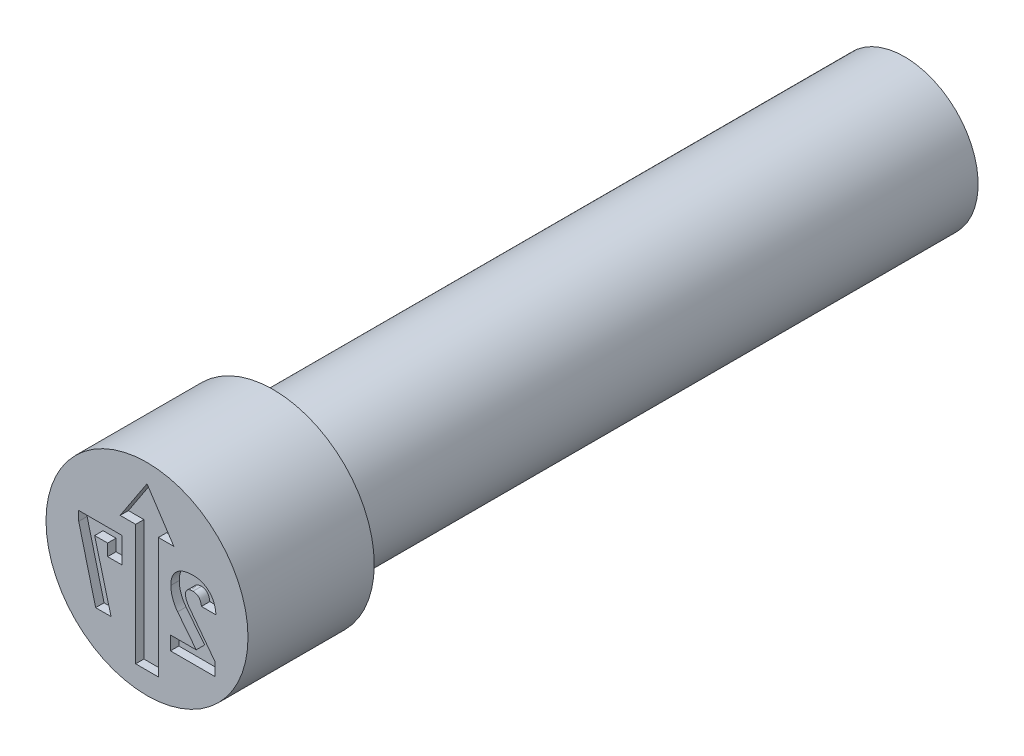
ISO-10303-21;
HEADER;
FILE_DESCRIPTION(('STEP AP214'),'2;1');
FILE_NAME('part.step','',(''),(''),'','','');
FILE_SCHEMA(('AUTOMOTIVE_DESIGN { 1 0 10303 214 1 1 1 1 }'));
ENDSEC;
DATA;
#1=APPLICATION_CONTEXT('core data for automotive mechanical design processes');
#2=APPLICATION_PROTOCOL_DEFINITION('international standard','automotive_design',2000,#1);
#3=PRODUCT_CONTEXT('',#1,'mechanical');
#4=PRODUCT('Part','Part','',(#3));
#5=PRODUCT_RELATED_PRODUCT_CATEGORY('part','',(#4));
#6=PRODUCT_DEFINITION_FORMATION('','',#4);
#7=PRODUCT_DEFINITION_CONTEXT('part definition',#1,'design');
#8=PRODUCT_DEFINITION('design','',#6,#7);
#9=PRODUCT_DEFINITION_SHAPE('','',#8);
#10=(LENGTH_UNIT() NAMED_UNIT(*) SI_UNIT(.MILLI.,.METRE.));
#11=(NAMED_UNIT(*) PLANE_ANGLE_UNIT() SI_UNIT($,.RADIAN.));
#12=(NAMED_UNIT(*) SI_UNIT($,.STERADIAN.) SOLID_ANGLE_UNIT());
#13=UNCERTAINTY_MEASURE_WITH_UNIT(LENGTH_MEASURE(1.E-05),#10,'distance_accuracy_value','');
#14=(GEOMETRIC_REPRESENTATION_CONTEXT(3) GLOBAL_UNCERTAINTY_ASSIGNED_CONTEXT((#13)) GLOBAL_UNIT_ASSIGNED_CONTEXT((#10,
#11,#12)) REPRESENTATION_CONTEXT('',''));
#15=CARTESIAN_POINT('',(0.,0.,0.));
#16=DIRECTION('',(0.,0.,1.));
#17=DIRECTION('',(1.,0.,0.));
#18=AXIS2_PLACEMENT_3D('',#15,#16,#17);
#19=CARTESIAN_POINT('',(-0.27,-1.88,-3.34769690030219));
#20=DIRECTION('',(-1.,0.,0.));
#21=DIRECTION('',(0.,0.,1.));
#22=AXIS2_PLACEMENT_3D('',#19,#20,#21);
#23=PLANE('',#22);
#24=DIRECTION('',(0.,-1.,0.));
#25=VECTOR('',#24,1.);
#26=CARTESIAN_POINT('',(-0.27,0.990629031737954,-0.19671914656));
#27=LINE('',#26,#25);
#28=CARTESIAN_POINT('',(-0.27,0.990629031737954,-0.19671914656));
#29=VERTEX_POINT('',#28);
#30=CARTESIAN_POINT('',(-0.27,-1.88,-0.19671914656));
#31=VERTEX_POINT('',#30);
#32=EDGE_CURVE('E439',#29,#31,#27,.T.);
#33=ORIENTED_EDGE('',*,*,#32,.F.);
#34=DIRECTION('',(0.,0.,1.));
#35=VECTOR('',#34,1.);
#36=CARTESIAN_POINT('',(-0.27,0.990629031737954,-0.21335957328));
#37=LINE('',#36,#35);
#38=CARTESIAN_POINT('',(-0.27,0.990629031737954,0.));
#39=VERTEX_POINT('',#38);
#40=EDGE_CURVE('E425',#39,#29,#37,.F.);
#41=ORIENTED_EDGE('',*,*,#40,.F.);
#42=DIRECTION('',(0.,1.,0.));
#43=VECTOR('',#42,1.);
#44=CARTESIAN_POINT('',(-0.27,0.,0.));
#45=LINE('',#44,#43);
#46=CARTESIAN_POINT('',(-0.27,-1.88,0.));
#47=VERTEX_POINT('',#46);
#48=EDGE_CURVE('E468',#47,#39,#45,.T.);
#49=ORIENTED_EDGE('',*,*,#48,.F.);
#50=DIRECTION('',(0.,0.,-1.));
#51=VECTOR('',#50,1.);
#52=CARTESIAN_POINT('',(-0.27,-1.88,-3.34769690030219));
#53=LINE('',#52,#51);
#54=EDGE_CURVE('E470',#47,#31,#53,.T.);
#55=ORIENTED_EDGE('',*,*,#54,.T.);
#56=EDGE_LOOP('',(#33,#41,#49,#55));
#57=FACE_BOUND('',#56,.T.);
#58=ADVANCED_FACE('F37',(#57),#23,.F.);
#59=CARTESIAN_POINT('',(3.694814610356E-13,0.990629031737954,-0.21335957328));
#60=DIRECTION('',(0.,1.,0.));
#61=DIRECTION('',(0.,0.,1.));
#62=AXIS2_PLACEMENT_3D('',#59,#60,#61);
#63=PLANE('',#62);
#64=ORIENTED_EDGE('',*,*,#40,.T.);
#65=DIRECTION('',(1.,0.,0.));
#66=VECTOR('',#65,1.);
#67=CARTESIAN_POINT('',(-0.638461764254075,0.990629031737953,-0.19671914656));
#68=LINE('',#67,#66);
#69=CARTESIAN_POINT('',(-0.63846176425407,0.990629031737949,-0.19671914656));
#70=VERTEX_POINT('',#69);
#71=EDGE_CURVE('E427',#70,#29,#68,.T.);
#72=ORIENTED_EDGE('',*,*,#71,.F.);
#73=DIRECTION('',(0.,0.,1.));
#74=VECTOR('',#73,1.);
#75=CARTESIAN_POINT('',(-0.63846176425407,0.990629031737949,-0.97535804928));
#76=LINE('',#75,#74);
#77=CARTESIAN_POINT('',(-0.638461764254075,0.990629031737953,0.));
#78=VERTEX_POINT('',#77);
#79=EDGE_CURVE('E432',#70,#78,#76,.T.);
#80=ORIENTED_EDGE('',*,*,#79,.T.);
#81=DIRECTION('',(1.,0.,0.));
#82=VECTOR('',#81,1.);
#83=CARTESIAN_POINT('',(1.1999976,0.990629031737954,0.));
#84=LINE('',#83,#82);
#85=EDGE_CURVE('E430',#39,#78,#84,.F.);
#86=ORIENTED_EDGE('',*,*,#85,.F.);
#87=EDGE_LOOP('',(#64,#72,#80,#86));
#88=FACE_BOUND('',#87,.T.);
#89=ADVANCED_FACE('F415',(#88),#63,.T.);
#90=CARTESIAN_POINT('',(-1.08287651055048,0.316073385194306,-0.97535804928));
#91=DIRECTION('',(-0.835059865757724,0.550159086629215,0.));
#92=DIRECTION('',(-0.550159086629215,-0.835059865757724,0.));
#93=AXIS2_PLACEMENT_3D('',#90,#91,#92);
#94=PLANE('',#93);
#95=DIRECTION('',(-0.550159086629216,-0.835059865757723,0.));
#96=VECTOR('',#95,1.);
#97=CARTESIAN_POINT('',(0.,1.95971926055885,-0.19671914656));
#98=LINE('',#97,#96);
#99=CARTESIAN_POINT('',(0.,1.95971926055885,-0.19671914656));
#100=VERTEX_POINT('',#99);
#101=EDGE_CURVE('E441',#100,#70,#98,.T.);
#102=ORIENTED_EDGE('',*,*,#101,.F.);
#103=DIRECTION('',(0.,0.,1.));
#104=VECTOR('',#103,1.);
#105=CARTESIAN_POINT('',(0.,1.95971926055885,-0.97535804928));
#106=LINE('',#105,#104);
#107=CARTESIAN_POINT('',(0.,1.95971926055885,0.));
#108=VERTEX_POINT('',#107);
#109=EDGE_CURVE('E480',#100,#108,#106,.T.);
#110=ORIENTED_EDGE('',*,*,#109,.T.);
#111=DIRECTION('',(0.550159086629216,0.835059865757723,0.));
#112=VECTOR('',#111,1.);
#113=CARTESIAN_POINT('',(-0.638461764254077,0.990629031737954,0.));
#114=LINE('',#113,#112);
#115=EDGE_CURVE('E464',#78,#108,#114,.T.);
#116=ORIENTED_EDGE('',*,*,#115,.F.);
#117=ORIENTED_EDGE('',*,*,#79,.F.);
#118=EDGE_LOOP('',(#102,#110,#116,#117));
#119=FACE_BOUND('',#118,.T.);
#120=ADVANCED_FACE('F412',(#119),#94,.F.);
#121=CARTESIAN_POINT('',(0.,1.95971926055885,-0.97535804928));
#122=DIRECTION('',(0.835059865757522,0.550159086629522,0.));
#123=DIRECTION('',(-0.550159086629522,0.835059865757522,0.));
#124=AXIS2_PLACEMENT_3D('',#121,#122,#123);
#125=PLANE('',#124);
#126=DIRECTION('',(-0.550159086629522,0.835059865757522,0.));
#127=VECTOR('',#126,1.);
#128=CARTESIAN_POINT('',(0.638461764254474,0.990629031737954,-0.19671914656));
#129=LINE('',#128,#127);
#130=CARTESIAN_POINT('',(0.638461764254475,0.990629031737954,-0.19671914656));
#131=VERTEX_POINT('',#130);
#132=EDGE_CURVE('E445',#131,#100,#129,.T.);
#133=ORIENTED_EDGE('',*,*,#132,.F.);
#134=DIRECTION('',(0.,0.,1.));
#135=VECTOR('',#134,1.);
#136=CARTESIAN_POINT('',(0.638461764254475,0.990629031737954,-0.21335957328));
#137=LINE('',#136,#135);
#138=CARTESIAN_POINT('',(0.638461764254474,0.990629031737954,0.));
#139=VERTEX_POINT('',#138);
#140=EDGE_CURVE('E477',#139,#131,#137,.F.);
#141=ORIENTED_EDGE('',*,*,#140,.F.);
#142=DIRECTION('',(0.550159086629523,-0.835059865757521,0.));
#143=VECTOR('',#142,1.);
#144=CARTESIAN_POINT('',(0.,1.95971926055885,0.));
#145=LINE('',#144,#143);
#146=EDGE_CURVE('E461',#108,#139,#145,.T.);
#147=ORIENTED_EDGE('',*,*,#146,.F.);
#148=ORIENTED_EDGE('',*,*,#109,.F.);
#149=EDGE_LOOP('',(#133,#141,#147,#148));
#150=FACE_BOUND('',#149,.T.);
#151=ADVANCED_FACE('F408',(#150),#125,.F.);
#152=CARTESIAN_POINT('',(3.694814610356E-13,0.990629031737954,-0.21335957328));
#153=DIRECTION('',(0.,1.,0.));
#154=DIRECTION('',(0.,0.,1.));
#155=AXIS2_PLACEMENT_3D('',#152,#153,#154);
#156=PLANE('',#155);
#157=ORIENTED_EDGE('',*,*,#140,.T.);
#158=DIRECTION('',(1.,0.,0.));
#159=VECTOR('',#158,1.);
#160=CARTESIAN_POINT('',(0.27,0.990629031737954,-0.19671914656));
#161=LINE('',#160,#159);
#162=CARTESIAN_POINT('',(0.27,0.990629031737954,-0.19671914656));
#163=VERTEX_POINT('',#162);
#164=EDGE_CURVE('E502',#163,#131,#161,.T.);
#165=ORIENTED_EDGE('',*,*,#164,.F.);
#166=DIRECTION('',(0.,0.,-1.));
#167=VECTOR('',#166,1.);
#168=CARTESIAN_POINT('',(0.27,0.990629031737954,-3.34769690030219));
#169=LINE('',#168,#167);
#170=CARTESIAN_POINT('',(0.27,0.990629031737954,0.));
#171=VERTEX_POINT('',#170);
#172=EDGE_CURVE('E475',#163,#171,#169,.F.);
#173=ORIENTED_EDGE('',*,*,#172,.T.);
#174=DIRECTION('',(1.,0.,0.));
#175=VECTOR('',#174,1.);
#176=CARTESIAN_POINT('',(1.1999976,0.990629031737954,0.));
#177=LINE('',#176,#175);
#178=EDGE_CURVE('E458',#139,#171,#177,.F.);
#179=ORIENTED_EDGE('',*,*,#178,.F.);
#180=EDGE_LOOP('',(#157,#165,#173,#179));
#181=FACE_BOUND('',#180,.T.);
#182=ADVANCED_FACE('F404',(#181),#156,.T.);
#183=CARTESIAN_POINT('',(0.27,-1.88,-3.34769690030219));
#184=DIRECTION('',(1.,0.,0.));
#185=DIRECTION('',(0.,0.,-1.));
#186=AXIS2_PLACEMENT_3D('',#183,#184,#185);
#187=PLANE('',#186);
#188=DIRECTION('',(0.,1.,0.));
#189=VECTOR('',#188,1.);
#190=CARTESIAN_POINT('',(0.27,-1.88,-0.19671914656));
#191=LINE('',#190,#189);
#192=CARTESIAN_POINT('',(0.27,-1.88,-0.19671914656));
#193=VERTEX_POINT('',#192);
#194=EDGE_CURVE('E433',#193,#163,#191,.T.);
#195=ORIENTED_EDGE('',*,*,#194,.F.);
#196=DIRECTION('',(0.,0.,-1.));
#197=VECTOR('',#196,1.);
#198=CARTESIAN_POINT('',(0.27,-1.88,-3.34769690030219));
#199=LINE('',#198,#197);
#200=CARTESIAN_POINT('',(0.27,-1.88,0.));
#201=VERTEX_POINT('',#200);
#202=EDGE_CURVE('E473',#193,#201,#199,.F.);
#203=ORIENTED_EDGE('',*,*,#202,.T.);
#204=DIRECTION('',(0.,1.,0.));
#205=VECTOR('',#204,1.);
#206=CARTESIAN_POINT('',(0.27,0.,0.));
#207=LINE('',#206,#205);
#208=EDGE_CURVE('E455',#171,#201,#207,.F.);
#209=ORIENTED_EDGE('',*,*,#208,.F.);
#210=ORIENTED_EDGE('',*,*,#172,.F.);
#211=EDGE_LOOP('',(#195,#203,#209,#210));
#212=FACE_BOUND('',#211,.T.);
#213=ADVANCED_FACE('F400',(#212),#187,.F.);
#214=CARTESIAN_POINT('',(-0.27,-1.88,-3.34769690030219));
#215=DIRECTION('',(0.,-1.,0.));
#216=DIRECTION('',(0.,0.,-1.));
#217=AXIS2_PLACEMENT_3D('',#214,#215,#216);
#218=PLANE('',#217);
#219=DIRECTION('',(1.,0.,0.));
#220=VECTOR('',#219,1.);
#221=CARTESIAN_POINT('',(-0.27,-1.88,-0.19671914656));
#222=LINE('',#221,#220);
#223=EDGE_CURVE('E443',#31,#193,#222,.T.);
#224=ORIENTED_EDGE('',*,*,#223,.F.);
#225=ORIENTED_EDGE('',*,*,#54,.F.);
#226=DIRECTION('',(1.,0.,0.));
#227=VECTOR('',#226,1.);
#228=CARTESIAN_POINT('',(1.1999976,-1.88,0.));
#229=LINE('',#228,#227);
#230=EDGE_CURVE('E452',#201,#47,#229,.F.);
#231=ORIENTED_EDGE('',*,*,#230,.F.);
#232=ORIENTED_EDGE('',*,*,#202,.F.);
#233=EDGE_LOOP('',(#224,#225,#231,#232));
#234=FACE_BOUND('',#233,.T.);
#235=ADVANCED_FACE('F383',(#234),#218,.F.);
#236=CARTESIAN_POINT('',(1.1999976,0.,0.));
#237=DIRECTION('',(0.,0.,1.));
#238=DIRECTION('',(1.,0.,0.));
#239=AXIS2_PLACEMENT_3D('',#236,#237,#238);
#240=PLANE('',#239);
#241=DIRECTION('',(-1.,0.,0.));
#242=VECTOR('',#241,1.);
#243=CARTESIAN_POINT('',(-0.598181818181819,0.6,0.));
#244=LINE('',#243,#242);
#245=CARTESIAN_POINT('',(-0.598181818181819,0.6,0.));
#246=VERTEX_POINT('',#245);
#247=CARTESIAN_POINT('',(-1.62237012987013,0.6,0.));
#248=VERTEX_POINT('',#247);
#249=EDGE_CURVE('E53',#246,#248,#244,.T.);
#250=ORIENTED_EDGE('',*,*,#249,.F.);
#251=DIRECTION('',(0.,1.,0.));
#252=VECTOR('',#251,1.);
#253=CARTESIAN_POINT('',(-0.598181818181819,-0.00779220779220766,0.));
#254=LINE('',#253,#252);
#255=CARTESIAN_POINT('',(-0.598181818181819,-0.00779220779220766,0.));
#256=VERTEX_POINT('',#255);
#257=EDGE_CURVE('E274',#256,#246,#254,.T.);
#258=ORIENTED_EDGE('',*,*,#257,.F.);
#259=DIRECTION('',(1.,0.,0.));
#260=VECTOR('',#259,1.);
#261=CARTESIAN_POINT('',(-0.936047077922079,-0.00779220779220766,0.));
#262=LINE('',#261,#260);
#263=CARTESIAN_POINT('',(-0.936047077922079,-0.00779220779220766,0.));
#264=VERTEX_POINT('',#263);
#265=EDGE_CURVE('E277',#264,#256,#262,.T.);
#266=ORIENTED_EDGE('',*,*,#265,.F.);
#267=DIRECTION('',(0.,-1.,0.));
#268=VECTOR('',#267,1.);
#269=CARTESIAN_POINT('',(-0.936047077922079,0.272727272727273,0.));
#270=LINE('',#269,#268);
#271=CARTESIAN_POINT('',(-0.936047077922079,0.272727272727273,0.));
#272=VERTEX_POINT('',#271);
#273=EDGE_CURVE('E311',#272,#264,#270,.T.);
#274=ORIENTED_EDGE('',*,*,#273,.F.);
#275=DIRECTION('',(1.,0.,0.));
#276=VECTOR('',#275,1.);
#277=CARTESIAN_POINT('',(-1.24396103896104,0.272727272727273,0.));
#278=LINE('',#277,#276);
#279=CARTESIAN_POINT('',(-1.24396103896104,0.272727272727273,0.));
#280=VERTEX_POINT('',#279);
#281=EDGE_CURVE('E308',#280,#272,#278,.T.);
#282=ORIENTED_EDGE('',*,*,#281,.F.);
#283=DIRECTION('',(-0.255602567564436,0.966781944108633,0.));
#284=VECTOR('',#283,1.);
#285=CARTESIAN_POINT('',(-0.854594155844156,-1.2,0.));
#286=LINE('',#285,#284);
#287=CARTESIAN_POINT('',(-0.854594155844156,-1.2,0.));
#288=VERTEX_POINT('',#287);
#289=EDGE_CURVE('E305',#288,#280,#286,.T.);
#290=ORIENTED_EDGE('',*,*,#289,.F.);
#291=DIRECTION('',(1.,0.,0.));
#292=VECTOR('',#291,1.);
#293=CARTESIAN_POINT('',(-1.22058441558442,-1.2,0.));
#294=LINE('',#293,#292);
#295=CARTESIAN_POINT('',(-1.22058441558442,-1.2,0.));
#296=VERTEX_POINT('',#295);
#297=EDGE_CURVE('E302',#296,#288,#294,.T.);
#298=ORIENTED_EDGE('',*,*,#297,.F.);
#299=DIRECTION('',(0.247293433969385,-0.968940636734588,0.));
#300=VECTOR('',#299,1.);
#301=CARTESIAN_POINT('',(-1.62237012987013,0.374269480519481,0.));
#302=LINE('',#301,#300);
#303=CARTESIAN_POINT('',(-1.62237012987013,0.374269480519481,0.));
#304=VERTEX_POINT('',#303);
#305=EDGE_CURVE('E299',#304,#296,#302,.T.);
#306=ORIENTED_EDGE('',*,*,#305,.F.);
#307=DIRECTION('',(0.,-1.,0.));
#308=VECTOR('',#307,1.);
#309=CARTESIAN_POINT('',(-1.62237012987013,0.6,0.));
#310=LINE('',#309,#308);
#311=EDGE_CURVE('E297',#248,#304,#310,.T.);
#312=ORIENTED_EDGE('',*,*,#311,.F.);
#313=EDGE_LOOP('',(#250,#258,#266,#274,#282,#290,#298,#306,#312));
#314=FACE_BOUND('',#313,.T.);
#315=DIRECTION('',(1.,0.,0.));
#316=VECTOR('',#315,1.);
#317=CARTESIAN_POINT('',(0.556696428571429,-1.2,0.));
#318=LINE('',#317,#316);
#319=CARTESIAN_POINT('',(0.556696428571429,-1.2,0.));
#320=VERTEX_POINT('',#319);
#321=CARTESIAN_POINT('',(1.61668019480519,-1.2,0.));
#322=VERTEX_POINT('',#321);
#323=EDGE_CURVE('E61',#320,#322,#318,.T.);
#324=ORIENTED_EDGE('',*,*,#323,.F.);
#325=DIRECTION('',(0.,-1.,0.));
#326=VECTOR('',#325,1.);
#327=CARTESIAN_POINT('',(0.556696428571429,-0.872727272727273,0.));
#328=LINE('',#327,#326);
#329=CARTESIAN_POINT('',(0.556696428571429,-0.872727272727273,0.));
#330=VERTEX_POINT('',#329);
#331=EDGE_CURVE('E335',#330,#320,#328,.T.);
#332=ORIENTED_EDGE('',*,*,#331,.F.);
#333=DIRECTION('',(-1.,0.,0.));
#334=VECTOR('',#333,1.);
#335=CARTESIAN_POINT('',(1.16923701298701,-0.872727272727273,0.));
#336=LINE('',#335,#334);
#337=CARTESIAN_POINT('',(1.16923701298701,-0.872727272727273,0.));
#338=VERTEX_POINT('',#337);
#339=EDGE_CURVE('E542',#338,#330,#336,.T.);
#340=ORIENTED_EDGE('',*,*,#339,.F.);
#341=DIRECTION('',(0.618183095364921,-0.786034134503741,0.));
#342=VECTOR('',#341,1.);
#343=CARTESIAN_POINT('',(0.728003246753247,-0.311688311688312,0.));
#344=LINE('',#343,#342);
#345=CARTESIAN_POINT('',(0.728003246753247,-0.311688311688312,0.));
#346=VERTEX_POINT('',#345);
#347=EDGE_CURVE('E545',#346,#338,#344,.T.);
#348=ORIENTED_EDGE('',*,*,#347,.F.);
#349=CARTESIAN_POINT('',(0.566558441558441,0.151461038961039,0.));
#350=CARTESIAN_POINT('',(0.567024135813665,0.130980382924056,0.));
#351=CARTESIAN_POINT('',(0.567956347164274,0.0899828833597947,0.));
#352=CARTESIAN_POINT('',(0.576371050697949,0.0286244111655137,0.));
#353=CARTESIAN_POINT('',(0.589931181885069,-0.0324207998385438,0.));
#354=CARTESIAN_POINT('',(0.608554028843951,-0.0928578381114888,0.));
#355=CARTESIAN_POINT('',(0.631688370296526,-0.151639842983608,0.));
#356=CARTESIAN_POINT('',(0.659454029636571,-0.207961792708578,0.));
#357=CARTESIAN_POINT('',(0.690791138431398,-0.261848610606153,0.));
#358=CARTESIAN_POINT('',(0.715622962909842,-0.295106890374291,0.));
#359=CARTESIAN_POINT('',(0.728003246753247,-0.311688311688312,0.));
#360=B_SPLINE_CURVE_WITH_KNOTS('',3,(#349,#350,#351,#352,#353,#354,#355,#356,#357,#358,#359),
.UNSPECIFIED.,.F.,.F.,(4,1,1,1,1,1,1,1,4),(0.,0.123046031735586,0.246309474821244,
0.371480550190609,0.498560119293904,0.626024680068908,0.750715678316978,0.875715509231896,1.),.UNSPECIFIED.);
#361=CARTESIAN_POINT('',(0.566558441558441,0.151461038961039,0.));
#362=VERTEX_POINT('',#361);
#363=EDGE_CURVE('E548',#362,#346,#360,.T.);
#364=ORIENTED_EDGE('',*,*,#363,.F.);
#365=DIRECTION('',(0.,-1.,0.));
#366=VECTOR('',#365,1.);
#367=CARTESIAN_POINT('',(0.566558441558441,0.152922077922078,0.));
#368=LINE('',#367,#366);
#369=CARTESIAN_POINT('',(0.566558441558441,0.152922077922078,0.));
#370=VERTEX_POINT('',#369);
#371=EDGE_CURVE('E553',#370,#362,#368,.T.);
#372=ORIENTED_EDGE('',*,*,#371,.F.);
#373=CARTESIAN_POINT('',(1.09655032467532,0.623376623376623,0.));
#374=CARTESIAN_POINT('',(1.07607927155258,0.623085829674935,0.));
#375=CARTESIAN_POINT('',(1.03626578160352,0.622520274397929,0.));
#376=CARTESIAN_POINT('',(0.978304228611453,0.61641528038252,0.));
#377=CARTESIAN_POINT('',(0.923768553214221,0.607201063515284,0.));
#378=CARTESIAN_POINT('',(0.872746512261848,0.593721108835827,0.));
#379=CARTESIAN_POINT('',(0.825442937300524,0.576137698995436,0.));
#380=CARTESIAN_POINT('',(0.781716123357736,0.554936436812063,0.));
#381=CARTESIAN_POINT('',(0.741474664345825,0.529936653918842,0.));
#382=CARTESIAN_POINT('',(0.705026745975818,0.501084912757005,0.));
#383=CARTESIAN_POINT('',(0.672232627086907,0.468905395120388,0.));
#384=CARTESIAN_POINT('',(0.644005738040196,0.433071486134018,0.));
#385=CARTESIAN_POINT('',(0.619570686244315,0.394307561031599,0.));
#386=CARTESIAN_POINT('',(0.600469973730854,0.351861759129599,0.));
#387=CARTESIAN_POINT('',(0.584744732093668,0.306732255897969,0.));
#388=CARTESIAN_POINT('',(0.574562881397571,0.25811011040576,0.));
#389=CARTESIAN_POINT('',(0.567701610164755,0.206567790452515,0.));
#390=CARTESIAN_POINT('',(0.566945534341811,0.171087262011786,0.));
#391=CARTESIAN_POINT('',(0.566558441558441,0.152922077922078,0.));
#392=B_SPLINE_CURVE_WITH_KNOTS('',3,(#373,#374,#375,#376,#377,#378,#379,#380,#381,#382,#383,
#384,#385,#386,#387,#388,#389,#390,#391),.UNSPECIFIED.,.F.,.F.,(4,1,1,1,1,1,1,1,1,1,1,1,1,1,1,1,
4),(0.,0.0762312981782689,0.148259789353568,0.216860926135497,0.28210063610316,
0.344528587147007,0.404571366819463,0.462840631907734,0.520642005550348,0.577409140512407,
0.633580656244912,0.690215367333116,0.747647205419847,0.806597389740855,0.867894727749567,
0.932365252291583,1.),.UNSPECIFIED.);
#393=CARTESIAN_POINT('',(1.09655032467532,0.623376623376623,0.));
#394=VERTEX_POINT('',#393);
#395=EDGE_CURVE('E559',#394,#370,#392,.T.);
#396=ORIENTED_EDGE('',*,*,#395,.F.);
#397=CARTESIAN_POINT('',(1.63896103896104,0.0831574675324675,0.));
#398=CARTESIAN_POINT('',(1.63725243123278,0.10402199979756,0.));
#399=CARTESIAN_POINT('',(1.63391726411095,0.144749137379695,0.));
#400=CARTESIAN_POINT('',(1.62298313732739,0.203662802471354,0.));
#401=CARTESIAN_POINT('',(1.608851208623,0.25915544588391,0.));
#402=CARTESIAN_POINT('',(1.59087349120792,0.311216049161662,0.));
#403=CARTESIAN_POINT('',(1.56777206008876,0.359241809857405,0.));
#404=CARTESIAN_POINT('',(1.54181690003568,0.404236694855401,0.));
#405=CARTESIAN_POINT('',(1.51059934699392,0.444809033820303,0.));
#406=CARTESIAN_POINT('',(1.47642736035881,0.482316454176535,0.));
#407=CARTESIAN_POINT('',(1.43836587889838,0.515352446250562,0.));
#408=CARTESIAN_POINT('',(1.39778188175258,0.544494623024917,0.));
#409=CARTESIAN_POINT('',(1.35406167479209,0.568745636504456,0.));
#410=CARTESIAN_POINT('',(1.30786992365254,0.588863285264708,0.));
#411=CARTESIAN_POINT('',(1.2586944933,0.604132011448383,0.));
#412=CARTESIAN_POINT('',(1.2071777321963,0.615569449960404,0.));
#413=CARTESIAN_POINT('',(1.15272832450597,0.622165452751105,0.));
#414=CARTESIAN_POINT('',(1.11556147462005,0.622966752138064,0.));
#415=CARTESIAN_POINT('',(1.09655032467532,0.623376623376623,0.));
#416=B_SPLINE_CURVE_WITH_KNOTS('',3,(#397,#398,#399,#400,#401,#402,#403,#404,#405,#406,#407,
#408,#409,#410,#411,#412,#413,#414,#415),.UNSPECIFIED.,.F.,.F.,(4,1,1,1,1,1,1,1,1,1,1,1,1,1,1,1,
4),(0.,0.0733268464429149,0.14313249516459,0.209679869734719,0.273918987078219,
0.335762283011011,0.396210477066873,0.45560885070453,0.514796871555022,0.573764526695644,
0.631900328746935,0.689592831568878,0.748648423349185,0.808163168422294,0.86976604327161,
0.933384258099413,1.),.UNSPECIFIED.);
#417=CARTESIAN_POINT('',(1.63896103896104,0.0831574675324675,0.));
#418=VERTEX_POINT('',#417);
#419=EDGE_CURVE('E564',#418,#394,#416,.T.);
#420=ORIENTED_EDGE('',*,*,#419,.F.);
#421=DIRECTION('',(0.,1.,0.));
#422=VECTOR('',#421,1.);
#423=CARTESIAN_POINT('',(1.63896103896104,0.0820616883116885,0.));
#424=LINE('',#423,#422);
#425=CARTESIAN_POINT('',(1.63896103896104,0.0820616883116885,0.));
#426=VERTEX_POINT('',#425);
#427=EDGE_CURVE('E572',#426,#418,#424,.T.);
#428=ORIENTED_EDGE('',*,*,#427,.F.);
#429=DIRECTION('',(1.,0.,0.));
#430=VECTOR('',#429,1.);
#431=CARTESIAN_POINT('',(1.29269480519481,0.0820616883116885,0.));
#432=LINE('',#431,#430);
#433=CARTESIAN_POINT('',(1.29269480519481,0.0820616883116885,0.));
#434=VERTEX_POINT('',#433);
#435=EDGE_CURVE('E578',#434,#426,#432,.T.);
#436=ORIENTED_EDGE('',*,*,#435,.F.);
#437=DIRECTION('',(0.,-1.,0.));
#438=VECTOR('',#437,1.);
#439=CARTESIAN_POINT('',(1.29269480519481,0.0831574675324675,0.));
#440=LINE('',#439,#438);
#441=CARTESIAN_POINT('',(1.29269480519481,0.0831574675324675,0.));
#442=VERTEX_POINT('',#441);
#443=EDGE_CURVE('E581',#442,#434,#440,.T.);
#444=ORIENTED_EDGE('',*,*,#443,.F.);
#445=CARTESIAN_POINT('',(1.09399350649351,0.296103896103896,0.));
#446=CARTESIAN_POINT('',(1.10722614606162,0.295587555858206,0.));
#447=CARTESIAN_POINT('',(1.13293762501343,0.294584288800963,0.));
#448=CARTESIAN_POINT('',(1.16933660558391,0.283465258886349,0.));
#449=CARTESIAN_POINT('',(1.20213563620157,0.266024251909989,0.));
#450=CARTESIAN_POINT('',(1.23041100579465,0.241138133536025,0.));
#451=CARTESIAN_POINT('',(1.2538251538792,0.20989267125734,0.));
#452=CARTESIAN_POINT('',(1.27282800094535,0.173098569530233,0.));
#453=CARTESIAN_POINT('',(1.28573459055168,0.130091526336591,0.));
#454=CARTESIAN_POINT('',(1.29030007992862,0.0993055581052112,0.));
#455=CARTESIAN_POINT('',(1.29269480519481,0.0831574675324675,0.));
#456=B_SPLINE_CURVE_WITH_KNOTS('',3,(#445,#446,#447,#448,#449,#450,#451,#452,#453,#454,#455),
.UNSPECIFIED.,.F.,.F.,(4,1,1,1,1,1,1,1,4),(0.,0.122603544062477,0.238222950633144,
0.350089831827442,0.465559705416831,0.585028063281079,0.711014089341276,0.848418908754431,1.),.UNSPECIFIED.);
#457=CARTESIAN_POINT('',(1.09399350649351,0.296103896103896,0.));
#458=VERTEX_POINT('',#457);
#459=EDGE_CURVE('E584',#458,#442,#456,.T.);
#460=ORIENTED_EDGE('',*,*,#459,.F.);
#461=CARTESIAN_POINT('',(0.914285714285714,0.143425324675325,0.));
#462=CARTESIAN_POINT('',(0.914784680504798,0.154934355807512,0.));
#463=CARTESIAN_POINT('',(0.915740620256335,0.17698382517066,0.));
#464=CARTESIAN_POINT('',(0.924747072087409,0.208051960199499,0.));
#465=CARTESIAN_POINT('',(0.939508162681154,0.235107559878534,0.));
#466=CARTESIAN_POINT('',(0.9606496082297,0.257455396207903,0.));
#467=CARTESIAN_POINT('',(0.986969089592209,0.275131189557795,0.));
#468=CARTESIAN_POINT('',(1.01846107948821,0.287588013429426,0.));
#469=CARTESIAN_POINT('',(1.05471353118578,0.294731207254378,0.));
#470=CARTESIAN_POINT('',(1.08044539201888,0.295630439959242,0.));
#471=CARTESIAN_POINT('',(1.09399350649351,0.296103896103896,0.));
#472=B_SPLINE_CURVE_WITH_KNOTS('',3,(#461,#462,#463,#464,#465,#466,#467,#468,#469,#470,#471),
.UNSPECIFIED.,.F.,.F.,(4,1,1,1,1,1,1,1,4),(0.,0.128749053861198,0.246662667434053,
0.359069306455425,0.47107757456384,0.588039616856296,0.711712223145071,0.848213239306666,1.),.UNSPECIFIED.);
#473=CARTESIAN_POINT('',(0.914285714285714,0.143425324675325,0.));
#474=VERTEX_POINT('',#473);
#475=EDGE_CURVE('E589',#474,#458,#472,.T.);
#476=ORIENTED_EDGE('',*,*,#475,.F.);
#477=DIRECTION('',(0.,1.,0.));
#478=VECTOR('',#477,1.);
#479=CARTESIAN_POINT('',(0.914285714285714,0.140868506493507,0.));
#480=LINE('',#479,#478);
#481=CARTESIAN_POINT('',(0.914285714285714,0.140868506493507,0.));
#482=VERTEX_POINT('',#481);
#483=EDGE_CURVE('E597',#482,#474,#480,.T.);
#484=ORIENTED_EDGE('',*,*,#483,.F.);
#485=CARTESIAN_POINT('',(1.00158279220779,-0.0790178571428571,0.));
#486=CARTESIAN_POINT('',(0.988699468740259,-0.0608645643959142,0.));
#487=CARTESIAN_POINT('',(0.963596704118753,-0.0254934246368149,0.));
#488=CARTESIAN_POINT('',(0.940876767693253,0.0230816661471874,0.));
#489=CARTESIAN_POINT('',(0.926723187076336,0.0611651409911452,0.));
#490=CARTESIAN_POINT('',(0.919977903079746,0.0887831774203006,0.));
#491=CARTESIAN_POINT('',(0.915166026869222,0.115133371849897,0.));
#492=CARTESIAN_POINT('',(0.914573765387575,0.132447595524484,0.));
#493=CARTESIAN_POINT('',(0.914285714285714,0.140868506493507,0.));
#494=B_SPLINE_CURVE_WITH_KNOTS('',3,(#485,#486,#487,#488,#489,#490,#491,#492,#493),
.UNSPECIFIED.,.F.,.F.,(4,1,1,1,1,1,4),(0.,0.27737542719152,0.540457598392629,0.666416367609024,
0.784009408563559,0.894951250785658,1.),.UNSPECIFIED.);
#495=CARTESIAN_POINT('',(1.00158279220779,-0.0790178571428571,0.));
#496=VERTEX_POINT('',#495);
#497=EDGE_CURVE('E603',#496,#482,#494,.T.);
#498=ORIENTED_EDGE('',*,*,#497,.F.);
#499=DIRECTION('',(-0.602458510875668,0.798150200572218,0.));
#500=VECTOR('',#499,1.);
#501=CARTESIAN_POINT('',(1.61668019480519,-0.893912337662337,0.));
#502=LINE('',#501,#500);
#503=CARTESIAN_POINT('',(1.61668019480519,-0.893912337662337,0.));
#504=VERTEX_POINT('',#503);
#505=EDGE_CURVE('E608',#504,#496,#502,.T.);
#506=ORIENTED_EDGE('',*,*,#505,.F.);
#507=DIRECTION('',(0.,1.,0.));
#508=VECTOR('',#507,1.);
#509=CARTESIAN_POINT('',(1.61668019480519,-1.2,0.));
#510=LINE('',#509,#508);
#511=EDGE_CURVE('E614',#322,#504,#510,.T.);
#512=ORIENTED_EDGE('',*,*,#511,.F.);
#513=EDGE_LOOP('',(#324,#332,#340,#348,#364,#372,#396,#420,#428,#436,#444,#460,#476,#484,#498,
#506,#512));
#514=FACE_BOUND('',#513,.T.);
#515=CARTESIAN_POINT('',(0.,0.,0.));
#516=DIRECTION('',(0.,0.,-1.));
#517=DIRECTION('',(-1.,0.,0.));
#518=AXIS2_PLACEMENT_3D('',#515,#516,#517);
#519=CIRCLE('',#518,2.3999952);
#520=CARTESIAN_POINT('',(-2.3999952,0.,0.));
#521=VERTEX_POINT('',#520);
#522=EDGE_CURVE('E40',#521,#521,#519,.T.);
#523=ORIENTED_EDGE('',*,*,#522,.F.);
#524=EDGE_LOOP('',(#523));
#525=FACE_BOUND('',#524,.T.);
#526=ORIENTED_EDGE('',*,*,#208,.T.);
#527=ORIENTED_EDGE('',*,*,#230,.T.);
#528=ORIENTED_EDGE('',*,*,#48,.T.);
#529=ORIENTED_EDGE('',*,*,#85,.T.);
#530=ORIENTED_EDGE('',*,*,#115,.T.);
#531=ORIENTED_EDGE('',*,*,#146,.T.);
#532=ORIENTED_EDGE('',*,*,#178,.T.);
#533=EDGE_LOOP('',(#526,#527,#528,#529,#530,#531,#532));
#534=FACE_BOUND('',#533,.T.);
#535=ADVANCED_FACE('F378',(#314,#514,#525,#534),#240,.T.);
#536=CARTESIAN_POINT('',(0.,0.,-1.499997));
#537=DIRECTION('',(0.,0.,-1.));
#538=DIRECTION('',(-1.,0.,0.));
#539=AXIS2_PLACEMENT_3D('',#536,#537,#538);
#540=CYLINDRICAL_SURFACE('',#539,2.3999952);
#541=ORIENTED_EDGE('',*,*,#522,.T.);
#542=EDGE_LOOP('',(#541));
#543=FACE_BOUND('',#542,.T.);
#544=CARTESIAN_POINT('',(0.,0.,-2.999994));
#545=DIRECTION('',(0.,0.,-1.));
#546=DIRECTION('',(-1.,0.,0.));
#547=AXIS2_PLACEMENT_3D('',#544,#545,#546);
#548=CIRCLE('',#547,2.3999952);
#549=CARTESIAN_POINT('',(-2.3999952,0.,-2.999994));
#550=VERTEX_POINT('',#549);
#551=EDGE_CURVE('E484',#550,#550,#548,.T.);
#552=ORIENTED_EDGE('',*,*,#551,.F.);
#553=EDGE_LOOP('',(#552));
#554=FACE_BOUND('',#553,.T.);
#555=ADVANCED_FACE('F390',(#543,#554),#540,.T.);
#556=CARTESIAN_POINT('',(0.87499825,0.,-17.999964));
#557=DIRECTION('',(0.,0.,-1.));
#558=DIRECTION('',(-1.,0.,0.));
#559=AXIS2_PLACEMENT_3D('',#556,#557,#558);
#560=PLANE('',#559);
#561=CARTESIAN_POINT('',(0.,0.,-17.999964));
#562=DIRECTION('',(0.,0.,-1.));
#563=DIRECTION('',(-1.,0.,0.));
#564=AXIS2_PLACEMENT_3D('',#561,#562,#563);
#565=CIRCLE('',#564,1.7499965);
#566=CARTESIAN_POINT('',(-1.74999649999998,0.,-17.999964));
#567=VERTEX_POINT('',#566);
#568=EDGE_CURVE('E45',#567,#567,#565,.F.);
#569=ORIENTED_EDGE('',*,*,#568,.F.);
#570=EDGE_LOOP('',(#569));
#571=FACE_BOUND('',#570,.T.);
#572=ADVANCED_FACE('F386',(#571),#560,.T.);
#573=CARTESIAN_POINT('',(2.07499585,0.,-2.999994));
#574=DIRECTION('',(0.,0.,-1.));
#575=DIRECTION('',(-1.,0.,0.));
#576=AXIS2_PLACEMENT_3D('',#573,#574,#575);
#577=PLANE('',#576);
#578=CARTESIAN_POINT('',(0.,0.,-2.999994));
#579=DIRECTION('',(0.,0.,-1.));
#580=DIRECTION('',(-1.,0.,0.));
#581=AXIS2_PLACEMENT_3D('',#578,#579,#580);
#582=CIRCLE('',#581,1.7499965);
#583=CARTESIAN_POINT('',(-1.74999649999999,0.,-2.999994));
#584=VERTEX_POINT('',#583);
#585=EDGE_CURVE('E11',#584,#584,#582,.T.);
#586=ORIENTED_EDGE('',*,*,#585,.F.);
#587=EDGE_LOOP('',(#586));
#588=FACE_BOUND('',#587,.T.);
#589=ORIENTED_EDGE('',*,*,#551,.T.);
#590=EDGE_LOOP('',(#589));
#591=FACE_BOUND('',#590,.T.);
#592=ADVANCED_FACE('F381',(#588,#591),#577,.T.);
#593=CARTESIAN_POINT('',(0.,0.,-10.499979));
#594=DIRECTION('',(0.,0.,-1.));
#595=DIRECTION('',(-1.,0.,0.));
#596=AXIS2_PLACEMENT_3D('',#593,#594,#595);
#597=CYLINDRICAL_SURFACE('',#596,1.7499965);
#598=ORIENTED_EDGE('',*,*,#568,.T.);
#599=EDGE_LOOP('',(#598));
#600=FACE_BOUND('',#599,.T.);
#601=ORIENTED_EDGE('',*,*,#585,.T.);
#602=EDGE_LOOP('',(#601));
#603=FACE_BOUND('',#602,.T.);
#604=ADVANCED_FACE('F376',(#600,#603),#597,.T.);
#605=CARTESIAN_POINT('',(0.,0.,-0.19671914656));
#606=DIRECTION('',(0.,0.,-1.));
#607=DIRECTION('',(-1.,0.,0.));
#608=AXIS2_PLACEMENT_3D('',#605,#606,#607);
#609=PLANE('',#608);
#610=ORIENTED_EDGE('',*,*,#164,.T.);
#611=ORIENTED_EDGE('',*,*,#132,.T.);
#612=ORIENTED_EDGE('',*,*,#101,.T.);
#613=ORIENTED_EDGE('',*,*,#71,.T.);
#614=ORIENTED_EDGE('',*,*,#32,.T.);
#615=ORIENTED_EDGE('',*,*,#223,.T.);
#616=ORIENTED_EDGE('',*,*,#194,.T.);
#617=EDGE_LOOP('',(#610,#611,#612,#613,#614,#615,#616));
#618=FACE_BOUND('',#617,.T.);
#619=ADVANCED_FACE('F373',(#618),#609,.F.);
#620=CARTESIAN_POINT('',(0.556696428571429,-1.2,-0.2));
#621=DIRECTION('',(0.,-1.,0.));
#622=DIRECTION('',(0.,0.,-1.));
#623=AXIS2_PLACEMENT_3D('',#620,#621,#622);
#624=PLANE('',#623);
#625=ORIENTED_EDGE('',*,*,#323,.T.);
#626=DIRECTION('',(0.,0.,1.));
#627=VECTOR('',#626,1.);
#628=CARTESIAN_POINT('',(1.61668019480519,-1.2,-0.2));
#629=LINE('',#628,#627);
#630=CARTESIAN_POINT('',(1.61668019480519,-1.2,-0.2));
#631=VERTEX_POINT('',#630);
#632=EDGE_CURVE('E508',#631,#322,#629,.T.);
#633=ORIENTED_EDGE('',*,*,#632,.F.);
#634=DIRECTION('',(1.,0.,0.));
#635=VECTOR('',#634,1.);
#636=CARTESIAN_POINT('',(0.556696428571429,-1.2,-0.2));
#637=LINE('',#636,#635);
#638=CARTESIAN_POINT('',(0.556696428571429,-1.2,-0.2));
#639=VERTEX_POINT('',#638);
#640=EDGE_CURVE('E331',#639,#631,#637,.T.);
#641=ORIENTED_EDGE('',*,*,#640,.F.);
#642=DIRECTION('',(0.,0.,1.));
#643=VECTOR('',#642,1.);
#644=CARTESIAN_POINT('',(0.556696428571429,-1.2,-0.2));
#645=LINE('',#644,#643);
#646=EDGE_CURVE('E503',#639,#320,#645,.T.);
#647=ORIENTED_EDGE('',*,*,#646,.T.);
#648=EDGE_LOOP('',(#625,#633,#641,#647));
#649=FACE_BOUND('',#648,.T.);
#650=ADVANCED_FACE('F369',(#649),#624,.F.);
#651=CARTESIAN_POINT('',(0.556696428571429,-0.872727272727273,-0.2));
#652=DIRECTION('',(-1.,0.,0.));
#653=DIRECTION('',(0.,0.,1.));
#654=AXIS2_PLACEMENT_3D('',#651,#652,#653);
#655=PLANE('',#654);
#656=ORIENTED_EDGE('',*,*,#331,.T.);
#657=ORIENTED_EDGE('',*,*,#646,.F.);
#658=DIRECTION('',(0.,-1.,0.));
#659=VECTOR('',#658,1.);
#660=CARTESIAN_POINT('',(0.556696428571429,-0.872727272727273,-0.2));
#661=LINE('',#660,#659);
#662=CARTESIAN_POINT('',(0.556696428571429,-0.872727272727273,-0.2));
#663=VERTEX_POINT('',#662);
#664=EDGE_CURVE('E511',#663,#639,#661,.T.);
#665=ORIENTED_EDGE('',*,*,#664,.F.);
#666=DIRECTION('',(0.,0.,1.));
#667=VECTOR('',#666,1.);
#668=CARTESIAN_POINT('',(0.556696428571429,-0.872727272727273,-0.2));
#669=LINE('',#668,#667);
#670=EDGE_CURVE('E505',#663,#330,#669,.T.);
#671=ORIENTED_EDGE('',*,*,#670,.T.);
#672=EDGE_LOOP('',(#656,#657,#665,#671));
#673=FACE_BOUND('',#672,.T.);
#674=ADVANCED_FACE('F372',(#673),#655,.F.);
#675=CARTESIAN_POINT('',(1.16923701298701,-0.872727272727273,-0.2));
#676=DIRECTION('',(0.,1.,0.));
#677=DIRECTION('',(0.,0.,1.));
#678=AXIS2_PLACEMENT_3D('',#675,#676,#677);
#679=PLANE('',#678);
#680=ORIENTED_EDGE('',*,*,#339,.T.);
#681=ORIENTED_EDGE('',*,*,#670,.F.);
#682=DIRECTION('',(-1.,0.,0.));
#683=VECTOR('',#682,1.);
#684=CARTESIAN_POINT('',(1.16923701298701,-0.872727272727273,-0.2));
#685=LINE('',#684,#683);
#686=CARTESIAN_POINT('',(1.16923701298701,-0.872727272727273,-0.2));
#687=VERTEX_POINT('',#686);
#688=EDGE_CURVE('E620',#687,#663,#685,.T.);
#689=ORIENTED_EDGE('',*,*,#688,.F.);
#690=DIRECTION('',(0.,0.,1.));
#691=VECTOR('',#690,1.);
#692=CARTESIAN_POINT('',(1.16923701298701,-0.872727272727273,-0.2));
#693=LINE('',#692,#691);
#694=EDGE_CURVE('E537',#687,#338,#693,.T.);
#695=ORIENTED_EDGE('',*,*,#694,.T.);
#696=EDGE_LOOP('',(#680,#681,#689,#695));
#697=FACE_BOUND('',#696,.T.);
#698=ADVANCED_FACE('F735',(#697),#679,.F.);
#699=CARTESIAN_POINT('',(0.728003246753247,-0.311688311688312,-0.2));
#700=DIRECTION('',(-0.786034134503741,-0.618183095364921,0.));
#701=DIRECTION('',(0.618183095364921,-0.786034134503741,0.));
#702=AXIS2_PLACEMENT_3D('',#699,#700,#701);
#703=PLANE('',#702);
#704=ORIENTED_EDGE('',*,*,#347,.T.);
#705=ORIENTED_EDGE('',*,*,#694,.F.);
#706=DIRECTION('',(0.618183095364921,-0.786034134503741,0.));
#707=VECTOR('',#706,1.);
#708=CARTESIAN_POINT('',(0.728003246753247,-0.311688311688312,-0.2));
#709=LINE('',#708,#707);
#710=CARTESIAN_POINT('',(0.728003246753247,-0.311688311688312,-0.2));
#711=VERTEX_POINT('',#710);
#712=EDGE_CURVE('E623',#711,#687,#709,.T.);
#713=ORIENTED_EDGE('',*,*,#712,.F.);
#714=DIRECTION('',(0.,0.,1.));
#715=VECTOR('',#714,1.);
#716=CARTESIAN_POINT('',(0.728003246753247,-0.311688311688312,-0.2));
#717=LINE('',#716,#715);
#718=EDGE_CURVE('E535',#711,#346,#717,.T.);
#719=ORIENTED_EDGE('',*,*,#718,.T.);
#720=EDGE_LOOP('',(#704,#705,#713,#719));
#721=FACE_BOUND('',#720,.T.);
#722=ADVANCED_FACE('F643',(#721),#703,.F.);
#723=CARTESIAN_POINT('',(0.566558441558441,0.151461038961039,-0.2));
#724=CARTESIAN_POINT('',(0.567024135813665,0.130980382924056,-0.2));
#725=CARTESIAN_POINT('',(0.567956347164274,0.0899828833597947,-0.2));
#726=CARTESIAN_POINT('',(0.576371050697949,0.0286244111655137,-0.2));
#727=CARTESIAN_POINT('',(0.589931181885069,-0.0324207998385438,-0.2));
#728=CARTESIAN_POINT('',(0.608554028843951,-0.0928578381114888,-0.2));
#729=CARTESIAN_POINT('',(0.631688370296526,-0.151639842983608,-0.2));
#730=CARTESIAN_POINT('',(0.659454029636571,-0.207961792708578,-0.2));
#731=CARTESIAN_POINT('',(0.690791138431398,-0.261848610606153,-0.2));
#732=CARTESIAN_POINT('',(0.715622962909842,-0.295106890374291,-0.2));
#733=CARTESIAN_POINT('',(0.728003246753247,-0.311688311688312,-0.2));
#734=B_SPLINE_CURVE_WITH_KNOTS('',3,(#723,#724,#725,#726,#727,#728,#729,#730,#731,#732,#733),
.UNSPECIFIED.,.F.,.F.,(4,1,1,1,1,1,1,1,4),(0.,0.123046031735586,0.246309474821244,
0.371480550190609,0.498560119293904,0.626024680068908,0.750715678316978,0.875715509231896,1.),.UNSPECIFIED.);
#735=DIRECTION('',(0.,0.,1.));
#736=VECTOR('',#735,1.);
#737=SURFACE_OF_LINEAR_EXTRUSION('',#734,#736);
#738=ORIENTED_EDGE('',*,*,#363,.T.);
#739=ORIENTED_EDGE('',*,*,#718,.F.);
#740=CARTESIAN_POINT('',(0.566558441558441,0.151461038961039,-0.2));
#741=VERTEX_POINT('',#740);
#742=EDGE_CURVE('E626',#741,#711,#734,.T.);
#743=ORIENTED_EDGE('',*,*,#742,.F.);
#744=DIRECTION('',(0.,0.,1.));
#745=VECTOR('',#744,1.);
#746=CARTESIAN_POINT('',(0.566558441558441,0.151461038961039,-0.2));
#747=LINE('',#746,#745);
#748=EDGE_CURVE('E533',#741,#362,#747,.T.);
#749=ORIENTED_EDGE('',*,*,#748,.T.);
#750=EDGE_LOOP('',(#738,#739,#743,#749));
#751=FACE_BOUND('',#750,.T.);
#752=ADVANCED_FACE('F638',(#751),#737,.F.);
#753=CARTESIAN_POINT('',(0.566558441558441,0.152922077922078,-0.2));
#754=DIRECTION('',(-1.,0.,0.));
#755=DIRECTION('',(0.,0.,1.));
#756=AXIS2_PLACEMENT_3D('',#753,#754,#755);
#757=PLANE('',#756);
#758=ORIENTED_EDGE('',*,*,#371,.T.);
#759=ORIENTED_EDGE('',*,*,#748,.F.);
#760=DIRECTION('',(0.,-1.,0.));
#761=VECTOR('',#760,1.);
#762=CARTESIAN_POINT('',(0.566558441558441,0.152922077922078,-0.2));
#763=LINE('',#762,#761);
#764=CARTESIAN_POINT('',(0.566558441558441,0.152922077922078,-0.2));
#765=VERTEX_POINT('',#764);
#766=EDGE_CURVE('E632',#765,#741,#763,.T.);
#767=ORIENTED_EDGE('',*,*,#766,.F.);
#768=DIRECTION('',(0.,0.,1.));
#769=VECTOR('',#768,1.);
#770=CARTESIAN_POINT('',(0.566558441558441,0.152922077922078,-0.2));
#771=LINE('',#770,#769);
#772=EDGE_CURVE('E531',#765,#370,#771,.T.);
#773=ORIENTED_EDGE('',*,*,#772,.T.);
#774=EDGE_LOOP('',(#758,#759,#767,#773));
#775=FACE_BOUND('',#774,.T.);
#776=ADVANCED_FACE('F642',(#775),#757,.F.);
#777=CARTESIAN_POINT('',(1.09655032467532,0.623376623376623,-0.2));
#778=CARTESIAN_POINT('',(1.07607927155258,0.623085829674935,-0.2));
#779=CARTESIAN_POINT('',(1.03626578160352,0.622520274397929,-0.2));
#780=CARTESIAN_POINT('',(0.978304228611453,0.61641528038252,-0.2));
#781=CARTESIAN_POINT('',(0.923768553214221,0.607201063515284,-0.2));
#782=CARTESIAN_POINT('',(0.872746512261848,0.593721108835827,-0.2));
#783=CARTESIAN_POINT('',(0.825442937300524,0.576137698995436,-0.2));
#784=CARTESIAN_POINT('',(0.781716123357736,0.554936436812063,-0.2));
#785=CARTESIAN_POINT('',(0.741474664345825,0.529936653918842,-0.2));
#786=CARTESIAN_POINT('',(0.705026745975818,0.501084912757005,-0.2));
#787=CARTESIAN_POINT('',(0.672232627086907,0.468905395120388,-0.2));
#788=CARTESIAN_POINT('',(0.644005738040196,0.433071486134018,-0.2));
#789=CARTESIAN_POINT('',(0.619570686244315,0.394307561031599,-0.2));
#790=CARTESIAN_POINT('',(0.600469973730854,0.351861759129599,-0.2));
#791=CARTESIAN_POINT('',(0.584744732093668,0.306732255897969,-0.2));
#792=CARTESIAN_POINT('',(0.574562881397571,0.25811011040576,-0.2));
#793=CARTESIAN_POINT('',(0.567701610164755,0.206567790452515,-0.2));
#794=CARTESIAN_POINT('',(0.566945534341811,0.171087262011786,-0.2));
#795=CARTESIAN_POINT('',(0.566558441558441,0.152922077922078,-0.2));
#796=B_SPLINE_CURVE_WITH_KNOTS('',3,(#777,#778,#779,#780,#781,#782,#783,#784,#785,#786,#787,
#788,#789,#790,#791,#792,#793,#794,#795),.UNSPECIFIED.,.F.,.F.,(4,1,1,1,1,1,1,1,1,1,1,1,1,1,1,1,
4),(0.,0.0762312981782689,0.148259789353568,0.216860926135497,0.28210063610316,
0.344528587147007,0.404571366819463,0.462840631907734,0.520642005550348,0.577409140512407,
0.633580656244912,0.690215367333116,0.747647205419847,0.806597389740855,0.867894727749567,
0.932365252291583,1.),.UNSPECIFIED.);
#797=DIRECTION('',(0.,0.,1.));
#798=VECTOR('',#797,1.);
#799=SURFACE_OF_LINEAR_EXTRUSION('',#796,#798);
#800=ORIENTED_EDGE('',*,*,#395,.T.);
#801=ORIENTED_EDGE('',*,*,#772,.F.);
#802=CARTESIAN_POINT('',(1.09655032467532,0.623376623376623,-0.2));
#803=VERTEX_POINT('',#802);
#804=EDGE_CURVE('E656',#803,#765,#796,.T.);
#805=ORIENTED_EDGE('',*,*,#804,.F.);
#806=DIRECTION('',(0.,0.,1.));
#807=VECTOR('',#806,1.);
#808=CARTESIAN_POINT('',(1.09655032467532,0.623376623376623,-0.2));
#809=LINE('',#808,#807);
#810=EDGE_CURVE('E529',#803,#394,#809,.T.);
#811=ORIENTED_EDGE('',*,*,#810,.T.);
#812=EDGE_LOOP('',(#800,#801,#805,#811));
#813=FACE_BOUND('',#812,.T.);
#814=ADVANCED_FACE('F648',(#813),#799,.F.);
#815=CARTESIAN_POINT('',(1.63896103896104,0.0831574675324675,-0.2));
#816=CARTESIAN_POINT('',(1.63725243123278,0.10402199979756,-0.2));
#817=CARTESIAN_POINT('',(1.63391726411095,0.144749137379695,-0.2));
#818=CARTESIAN_POINT('',(1.62298313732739,0.203662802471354,-0.2));
#819=CARTESIAN_POINT('',(1.608851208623,0.25915544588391,-0.2));
#820=CARTESIAN_POINT('',(1.59087349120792,0.311216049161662,-0.2));
#821=CARTESIAN_POINT('',(1.56777206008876,0.359241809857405,-0.2));
#822=CARTESIAN_POINT('',(1.54181690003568,0.404236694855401,-0.2));
#823=CARTESIAN_POINT('',(1.51059934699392,0.444809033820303,-0.2));
#824=CARTESIAN_POINT('',(1.47642736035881,0.482316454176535,-0.2));
#825=CARTESIAN_POINT('',(1.43836587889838,0.515352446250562,-0.2));
#826=CARTESIAN_POINT('',(1.39778188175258,0.544494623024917,-0.2));
#827=CARTESIAN_POINT('',(1.35406167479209,0.568745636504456,-0.2));
#828=CARTESIAN_POINT('',(1.30786992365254,0.588863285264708,-0.2));
#829=CARTESIAN_POINT('',(1.2586944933,0.604132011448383,-0.2));
#830=CARTESIAN_POINT('',(1.2071777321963,0.615569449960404,-0.2));
#831=CARTESIAN_POINT('',(1.15272832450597,0.622165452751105,-0.2));
#832=CARTESIAN_POINT('',(1.11556147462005,0.622966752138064,-0.2));
#833=CARTESIAN_POINT('',(1.09655032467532,0.623376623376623,-0.2));
#834=B_SPLINE_CURVE_WITH_KNOTS('',3,(#815,#816,#817,#818,#819,#820,#821,#822,#823,#824,#825,
#826,#827,#828,#829,#830,#831,#832,#833),.UNSPECIFIED.,.F.,.F.,(4,1,1,1,1,1,1,1,1,1,1,1,1,1,1,1,
4),(0.,0.0733268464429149,0.14313249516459,0.209679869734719,0.273918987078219,
0.335762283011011,0.396210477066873,0.45560885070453,0.514796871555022,0.573764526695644,
0.631900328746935,0.689592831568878,0.748648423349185,0.808163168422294,0.86976604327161,
0.933384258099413,1.),.UNSPECIFIED.);
#835=DIRECTION('',(0.,0.,1.));
#836=VECTOR('',#835,1.);
#837=SURFACE_OF_LINEAR_EXTRUSION('',#834,#836);
#838=ORIENTED_EDGE('',*,*,#419,.T.);
#839=ORIENTED_EDGE('',*,*,#810,.F.);
#840=CARTESIAN_POINT('',(1.63896103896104,0.0831574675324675,-0.2));
#841=VERTEX_POINT('',#840);
#842=EDGE_CURVE('E661',#841,#803,#834,.T.);
#843=ORIENTED_EDGE('',*,*,#842,.F.);
#844=DIRECTION('',(0.,0.,1.));
#845=VECTOR('',#844,1.);
#846=CARTESIAN_POINT('',(1.63896103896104,0.0831574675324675,-0.2));
#847=LINE('',#846,#845);
#848=EDGE_CURVE('E527',#841,#418,#847,.T.);
#849=ORIENTED_EDGE('',*,*,#848,.T.);
#850=EDGE_LOOP('',(#838,#839,#843,#849));
#851=FACE_BOUND('',#850,.T.);
#852=ADVANCED_FACE('F652',(#851),#837,.F.);
#853=CARTESIAN_POINT('',(1.63896103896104,0.0820616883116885,-0.2));
#854=DIRECTION('',(1.,0.,0.));
#855=DIRECTION('',(0.,0.,-1.));
#856=AXIS2_PLACEMENT_3D('',#853,#854,#855);
#857=PLANE('',#856);
#858=ORIENTED_EDGE('',*,*,#427,.T.);
#859=ORIENTED_EDGE('',*,*,#848,.F.);
#860=DIRECTION('',(0.,1.,0.));
#861=VECTOR('',#860,1.);
#862=CARTESIAN_POINT('',(1.63896103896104,0.0820616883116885,-0.2));
#863=LINE('',#862,#861);
#864=CARTESIAN_POINT('',(1.63896103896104,0.0820616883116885,-0.2));
#865=VERTEX_POINT('',#864);
#866=EDGE_CURVE('E670',#865,#841,#863,.T.);
#867=ORIENTED_EDGE('',*,*,#866,.F.);
#868=DIRECTION('',(0.,0.,1.));
#869=VECTOR('',#868,1.);
#870=CARTESIAN_POINT('',(1.63896103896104,0.0820616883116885,-0.2));
#871=LINE('',#870,#869);
#872=EDGE_CURVE('E525',#865,#426,#871,.T.);
#873=ORIENTED_EDGE('',*,*,#872,.T.);
#874=EDGE_LOOP('',(#858,#859,#867,#873));
#875=FACE_BOUND('',#874,.T.);
#876=ADVANCED_FACE('F751',(#875),#857,.F.);
#877=CARTESIAN_POINT('',(1.29269480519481,0.0820616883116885,-0.2));
#878=DIRECTION('',(0.,-1.,0.));
#879=DIRECTION('',(0.,0.,-1.));
#880=AXIS2_PLACEMENT_3D('',#877,#878,#879);
#881=PLANE('',#880);
#882=ORIENTED_EDGE('',*,*,#435,.T.);
#883=ORIENTED_EDGE('',*,*,#872,.F.);
#884=DIRECTION('',(1.,0.,0.));
#885=VECTOR('',#884,1.);
#886=CARTESIAN_POINT('',(1.29269480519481,0.0820616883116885,-0.2));
#887=LINE('',#886,#885);
#888=CARTESIAN_POINT('',(1.29269480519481,0.0820616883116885,-0.2));
#889=VERTEX_POINT('',#888);
#890=EDGE_CURVE('E676',#889,#865,#887,.T.);
#891=ORIENTED_EDGE('',*,*,#890,.F.);
#892=DIRECTION('',(0.,0.,1.));
#893=VECTOR('',#892,1.);
#894=CARTESIAN_POINT('',(1.29269480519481,0.0820616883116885,-0.2));
#895=LINE('',#894,#893);
#896=EDGE_CURVE('E523',#889,#434,#895,.T.);
#897=ORIENTED_EDGE('',*,*,#896,.T.);
#898=EDGE_LOOP('',(#882,#883,#891,#897));
#899=FACE_BOUND('',#898,.T.);
#900=ADVANCED_FACE('F754',(#899),#881,.F.);
#901=CARTESIAN_POINT('',(1.29269480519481,0.0831574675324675,-0.2));
#902=DIRECTION('',(-1.,0.,0.));
#903=DIRECTION('',(0.,0.,1.));
#904=AXIS2_PLACEMENT_3D('',#901,#902,#903);
#905=PLANE('',#904);
#906=ORIENTED_EDGE('',*,*,#443,.T.);
#907=ORIENTED_EDGE('',*,*,#896,.F.);
#908=DIRECTION('',(0.,-1.,0.));
#909=VECTOR('',#908,1.);
#910=CARTESIAN_POINT('',(1.29269480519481,0.0831574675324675,-0.2));
#911=LINE('',#910,#909);
#912=CARTESIAN_POINT('',(1.29269480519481,0.0831574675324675,-0.2));
#913=VERTEX_POINT('',#912);
#914=EDGE_CURVE('E679',#913,#889,#911,.T.);
#915=ORIENTED_EDGE('',*,*,#914,.F.);
#916=DIRECTION('',(0.,0.,1.));
#917=VECTOR('',#916,1.);
#918=CARTESIAN_POINT('',(1.29269480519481,0.0831574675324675,-0.2));
#919=LINE('',#918,#917);
#920=EDGE_CURVE('E521',#913,#442,#919,.T.);
#921=ORIENTED_EDGE('',*,*,#920,.T.);
#922=EDGE_LOOP('',(#906,#907,#915,#921));
#923=FACE_BOUND('',#922,.T.);
#924=ADVANCED_FACE('F699',(#923),#905,.F.);
#925=CARTESIAN_POINT('',(1.09399350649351,0.296103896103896,-0.2));
#926=CARTESIAN_POINT('',(1.10722614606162,0.295587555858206,-0.2));
#927=CARTESIAN_POINT('',(1.13293762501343,0.294584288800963,-0.2));
#928=CARTESIAN_POINT('',(1.16933660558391,0.283465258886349,-0.2));
#929=CARTESIAN_POINT('',(1.20213563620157,0.266024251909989,-0.2));
#930=CARTESIAN_POINT('',(1.23041100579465,0.241138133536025,-0.2));
#931=CARTESIAN_POINT('',(1.2538251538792,0.20989267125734,-0.2));
#932=CARTESIAN_POINT('',(1.27282800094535,0.173098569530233,-0.2));
#933=CARTESIAN_POINT('',(1.28573459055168,0.130091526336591,-0.2));
#934=CARTESIAN_POINT('',(1.29030007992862,0.0993055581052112,-0.2));
#935=CARTESIAN_POINT('',(1.29269480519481,0.0831574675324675,-0.2));
#936=B_SPLINE_CURVE_WITH_KNOTS('',3,(#925,#926,#927,#928,#929,#930,#931,#932,#933,#934,#935),
.UNSPECIFIED.,.F.,.F.,(4,1,1,1,1,1,1,1,4),(0.,0.122603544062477,0.238222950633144,
0.350089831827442,0.465559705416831,0.585028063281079,0.711014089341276,0.848418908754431,1.),.UNSPECIFIED.);
#937=DIRECTION('',(0.,0.,1.));
#938=VECTOR('',#937,1.);
#939=SURFACE_OF_LINEAR_EXTRUSION('',#936,#938);
#940=ORIENTED_EDGE('',*,*,#459,.T.);
#941=ORIENTED_EDGE('',*,*,#920,.F.);
#942=CARTESIAN_POINT('',(1.09399350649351,0.296103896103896,-0.2));
#943=VERTEX_POINT('',#942);
#944=EDGE_CURVE('E682',#943,#913,#936,.T.);
#945=ORIENTED_EDGE('',*,*,#944,.F.);
#946=DIRECTION('',(0.,0.,1.));
#947=VECTOR('',#946,1.);
#948=CARTESIAN_POINT('',(1.09399350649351,0.296103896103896,-0.2));
#949=LINE('',#948,#947);
#950=EDGE_CURVE('E519',#943,#458,#949,.T.);
#951=ORIENTED_EDGE('',*,*,#950,.T.);
#952=EDGE_LOOP('',(#940,#941,#945,#951));
#953=FACE_BOUND('',#952,.T.);
#954=ADVANCED_FACE('F695',(#953),#939,.F.);
#955=CARTESIAN_POINT('',(0.914285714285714,0.143425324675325,-0.2));
#956=CARTESIAN_POINT('',(0.914784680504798,0.154934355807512,-0.2));
#957=CARTESIAN_POINT('',(0.915740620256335,0.17698382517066,-0.2));
#958=CARTESIAN_POINT('',(0.924747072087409,0.208051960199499,-0.2));
#959=CARTESIAN_POINT('',(0.939508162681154,0.235107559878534,-0.2));
#960=CARTESIAN_POINT('',(0.9606496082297,0.257455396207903,-0.2));
#961=CARTESIAN_POINT('',(0.986969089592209,0.275131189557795,-0.2));
#962=CARTESIAN_POINT('',(1.01846107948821,0.287588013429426,-0.2));
#963=CARTESIAN_POINT('',(1.05471353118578,0.294731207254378,-0.2));
#964=CARTESIAN_POINT('',(1.08044539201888,0.295630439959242,-0.2));
#965=CARTESIAN_POINT('',(1.09399350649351,0.296103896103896,-0.2));
#966=B_SPLINE_CURVE_WITH_KNOTS('',3,(#955,#956,#957,#958,#959,#960,#961,#962,#963,#964,#965),
.UNSPECIFIED.,.F.,.F.,(4,1,1,1,1,1,1,1,4),(0.,0.128749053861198,0.246662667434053,
0.359069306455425,0.47107757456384,0.588039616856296,0.711712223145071,0.848213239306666,1.),.UNSPECIFIED.);
#967=DIRECTION('',(0.,0.,1.));
#968=VECTOR('',#967,1.);
#969=SURFACE_OF_LINEAR_EXTRUSION('',#966,#968);
#970=ORIENTED_EDGE('',*,*,#475,.T.);
#971=ORIENTED_EDGE('',*,*,#950,.F.);
#972=CARTESIAN_POINT('',(0.914285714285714,0.143425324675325,-0.2));
#973=VERTEX_POINT('',#972);
#974=EDGE_CURVE('E687',#973,#943,#966,.T.);
#975=ORIENTED_EDGE('',*,*,#974,.F.);
#976=DIRECTION('',(0.,0.,1.));
#977=VECTOR('',#976,1.);
#978=CARTESIAN_POINT('',(0.914285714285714,0.143425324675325,-0.2));
#979=LINE('',#978,#977);
#980=EDGE_CURVE('E517',#973,#474,#979,.T.);
#981=ORIENTED_EDGE('',*,*,#980,.T.);
#982=EDGE_LOOP('',(#970,#971,#975,#981));
#983=FACE_BOUND('',#982,.T.);
#984=ADVANCED_FACE('F698',(#983),#969,.F.);
#985=CARTESIAN_POINT('',(0.914285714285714,0.140868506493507,-0.2));
#986=DIRECTION('',(1.,0.,0.));
#987=DIRECTION('',(0.,0.,-1.));
#988=AXIS2_PLACEMENT_3D('',#985,#986,#987);
#989=PLANE('',#988);
#990=ORIENTED_EDGE('',*,*,#483,.T.);
#991=ORIENTED_EDGE('',*,*,#980,.F.);
#992=DIRECTION('',(0.,1.,0.));
#993=VECTOR('',#992,1.);
#994=CARTESIAN_POINT('',(0.914285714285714,0.140868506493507,-0.2));
#995=LINE('',#994,#993);
#996=CARTESIAN_POINT('',(0.914285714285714,0.140868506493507,-0.2));
#997=VERTEX_POINT('',#996);
#998=EDGE_CURVE('E347',#997,#973,#995,.T.);
#999=ORIENTED_EDGE('',*,*,#998,.F.);
#1000=DIRECTION('',(0.,0.,1.));
#1001=VECTOR('',#1000,1.);
#1002=CARTESIAN_POINT('',(0.914285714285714,0.140868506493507,-0.2));
#1003=LINE('',#1002,#1001);
#1004=EDGE_CURVE('E515',#997,#482,#1003,.T.);
#1005=ORIENTED_EDGE('',*,*,#1004,.T.);
#1006=EDGE_LOOP('',(#990,#991,#999,#1005));
#1007=FACE_BOUND('',#1006,.T.);
#1008=ADVANCED_FACE('F358',(#1007),#989,.F.);
#1009=CARTESIAN_POINT('',(1.00158279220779,-0.0790178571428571,-0.2));
#1010=CARTESIAN_POINT('',(0.988699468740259,-0.0608645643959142,-0.2));
#1011=CARTESIAN_POINT('',(0.963596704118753,-0.0254934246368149,-0.2));
#1012=CARTESIAN_POINT('',(0.940876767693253,0.0230816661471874,-0.2));
#1013=CARTESIAN_POINT('',(0.926723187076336,0.0611651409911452,-0.2));
#1014=CARTESIAN_POINT('',(0.919977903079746,0.0887831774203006,-0.2));
#1015=CARTESIAN_POINT('',(0.915166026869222,0.115133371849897,-0.2));
#1016=CARTESIAN_POINT('',(0.914573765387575,0.132447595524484,-0.2));
#1017=CARTESIAN_POINT('',(0.914285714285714,0.140868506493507,-0.2));
#1018=B_SPLINE_CURVE_WITH_KNOTS('',3,(#1009,#1010,#1011,#1012,#1013,#1014,#1015,#1016,#1017),
.UNSPECIFIED.,.F.,.F.,(4,1,1,1,1,1,4),(0.,0.27737542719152,0.540457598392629,0.666416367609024,
0.784009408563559,0.894951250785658,1.),.UNSPECIFIED.);
#1019=DIRECTION('',(0.,0.,1.));
#1020=VECTOR('',#1019,1.);
#1021=SURFACE_OF_LINEAR_EXTRUSION('',#1018,#1020);
#1022=ORIENTED_EDGE('',*,*,#497,.T.);
#1023=ORIENTED_EDGE('',*,*,#1004,.F.);
#1024=CARTESIAN_POINT('',(1.00158279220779,-0.0790178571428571,-0.2));
#1025=VERTEX_POINT('',#1024);
#1026=EDGE_CURVE('E341',#1025,#997,#1018,.T.);
#1027=ORIENTED_EDGE('',*,*,#1026,.F.);
#1028=DIRECTION('',(0.,0.,1.));
#1029=VECTOR('',#1028,1.);
#1030=CARTESIAN_POINT('',(1.00158279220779,-0.0790178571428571,-0.2));
#1031=LINE('',#1030,#1029);
#1032=EDGE_CURVE('E513',#1025,#496,#1031,.T.);
#1033=ORIENTED_EDGE('',*,*,#1032,.T.);
#1034=EDGE_LOOP('',(#1022,#1023,#1027,#1033));
#1035=FACE_BOUND('',#1034,.T.);
#1036=ADVANCED_FACE('F353',(#1035),#1021,.F.);
#1037=CARTESIAN_POINT('',(1.61668019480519,-0.893912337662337,-0.2));
#1038=DIRECTION('',(0.798150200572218,0.602458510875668,0.));
#1039=DIRECTION('',(-0.602458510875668,0.798150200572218,0.));
#1040=AXIS2_PLACEMENT_3D('',#1037,#1038,#1039);
#1041=PLANE('',#1040);
#1042=ORIENTED_EDGE('',*,*,#505,.T.);
#1043=ORIENTED_EDGE('',*,*,#1032,.F.);
#1044=DIRECTION('',(-0.602458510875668,0.798150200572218,0.));
#1045=VECTOR('',#1044,1.);
#1046=CARTESIAN_POINT('',(1.61668019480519,-0.893912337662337,-0.2));
#1047=LINE('',#1046,#1045);
#1048=CARTESIAN_POINT('',(1.61668019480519,-0.893912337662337,-0.2));
#1049=VERTEX_POINT('',#1048);
#1050=EDGE_CURVE('E338',#1049,#1025,#1047,.T.);
#1051=ORIENTED_EDGE('',*,*,#1050,.F.);
#1052=DIRECTION('',(0.,0.,1.));
#1053=VECTOR('',#1052,1.);
#1054=CARTESIAN_POINT('',(1.61668019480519,-0.893912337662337,-0.2));
#1055=LINE('',#1054,#1053);
#1056=EDGE_CURVE('E510',#1049,#504,#1055,.T.);
#1057=ORIENTED_EDGE('',*,*,#1056,.T.);
#1058=EDGE_LOOP('',(#1042,#1043,#1051,#1057));
#1059=FACE_BOUND('',#1058,.T.);
#1060=ADVANCED_FACE('F357',(#1059),#1041,.F.);
#1061=CARTESIAN_POINT('',(1.61668019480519,-1.2,-0.2));
#1062=DIRECTION('',(1.,0.,0.));
#1063=DIRECTION('',(0.,0.,-1.));
#1064=AXIS2_PLACEMENT_3D('',#1061,#1062,#1063);
#1065=PLANE('',#1064);
#1066=ORIENTED_EDGE('',*,*,#511,.T.);
#1067=ORIENTED_EDGE('',*,*,#1056,.F.);
#1068=DIRECTION('',(0.,1.,0.));
#1069=VECTOR('',#1068,1.);
#1070=CARTESIAN_POINT('',(1.61668019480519,-1.2,-0.2));
#1071=LINE('',#1070,#1069);
#1072=EDGE_CURVE('E334',#631,#1049,#1071,.T.);
#1073=ORIENTED_EDGE('',*,*,#1072,.F.);
#1074=ORIENTED_EDGE('',*,*,#632,.T.);
#1075=EDGE_LOOP('',(#1066,#1067,#1073,#1074));
#1076=FACE_BOUND('',#1075,.T.);
#1077=ADVANCED_FACE('F363',(#1076),#1065,.F.);
#1078=CARTESIAN_POINT('',(0.941009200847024,0.0244789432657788,-0.2));
#1079=DIRECTION('',(0.,0.,1.));
#1080=DIRECTION('',(1.,0.,0.));
#1081=AXIS2_PLACEMENT_3D('',#1078,#1079,#1080);
#1082=PLANE('',#1081);
#1083=ORIENTED_EDGE('',*,*,#640,.T.);
#1084=ORIENTED_EDGE('',*,*,#1072,.T.);
#1085=ORIENTED_EDGE('',*,*,#1050,.T.);
#1086=ORIENTED_EDGE('',*,*,#1026,.T.);
#1087=ORIENTED_EDGE('',*,*,#998,.T.);
#1088=ORIENTED_EDGE('',*,*,#974,.T.);
#1089=ORIENTED_EDGE('',*,*,#944,.T.);
#1090=ORIENTED_EDGE('',*,*,#914,.T.);
#1091=ORIENTED_EDGE('',*,*,#890,.T.);
#1092=ORIENTED_EDGE('',*,*,#866,.T.);
#1093=ORIENTED_EDGE('',*,*,#842,.T.);
#1094=ORIENTED_EDGE('',*,*,#804,.T.);
#1095=ORIENTED_EDGE('',*,*,#766,.T.);
#1096=ORIENTED_EDGE('',*,*,#742,.T.);
#1097=ORIENTED_EDGE('',*,*,#712,.T.);
#1098=ORIENTED_EDGE('',*,*,#688,.T.);
#1099=ORIENTED_EDGE('',*,*,#664,.T.);
#1100=EDGE_LOOP('',(#1083,#1084,#1085,#1086,#1087,#1088,#1089,#1090,#1091,#1092,#1093,#1094,
#1095,#1096,#1097,#1098,#1099));
#1101=FACE_BOUND('',#1100,.T.);
#1102=ADVANCED_FACE('F367',(#1101),#1082,.T.);
#1103=CARTESIAN_POINT('',(-0.598181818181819,0.6,-0.2));
#1104=DIRECTION('',(0.,1.,0.));
#1105=DIRECTION('',(0.,0.,1.));
#1106=AXIS2_PLACEMENT_3D('',#1103,#1104,#1105);
#1107=PLANE('',#1106);
#1108=ORIENTED_EDGE('',*,*,#249,.T.);
#1109=DIRECTION('',(0.,0.,1.));
#1110=VECTOR('',#1109,1.);
#1111=CARTESIAN_POINT('',(-1.62237012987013,0.6,-0.2));
#1112=LINE('',#1111,#1110);
#1113=CARTESIAN_POINT('',(-1.62237012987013,0.6,-0.2));
#1114=VERTEX_POINT('',#1113);
#1115=EDGE_CURVE('E251',#1114,#248,#1112,.T.);
#1116=ORIENTED_EDGE('',*,*,#1115,.F.);
#1117=DIRECTION('',(-1.,0.,0.));
#1118=VECTOR('',#1117,1.);
#1119=CARTESIAN_POINT('',(-0.598181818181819,0.6,-0.2));
#1120=LINE('',#1119,#1118);
#1121=CARTESIAN_POINT('',(-0.598181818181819,0.6,-0.2));
#1122=VERTEX_POINT('',#1121);
#1123=EDGE_CURVE('E255',#1122,#1114,#1120,.T.);
#1124=ORIENTED_EDGE('',*,*,#1123,.F.);
#1125=DIRECTION('',(0.,0.,1.));
#1126=VECTOR('',#1125,1.);
#1127=CARTESIAN_POINT('',(-0.598181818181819,0.6,-0.2));
#1128=LINE('',#1127,#1126);
#1129=EDGE_CURVE('E316',#1122,#246,#1128,.T.);
#1130=ORIENTED_EDGE('',*,*,#1129,.T.);
#1131=EDGE_LOOP('',(#1108,#1116,#1124,#1130));
#1132=FACE_BOUND('',#1131,.T.);
#1133=ADVANCED_FACE('F253',(#1132),#1107,.F.);
#1134=CARTESIAN_POINT('',(-0.598181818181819,-0.00779220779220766,-0.2));
#1135=DIRECTION('',(1.,0.,0.));
#1136=DIRECTION('',(0.,0.,-1.));
#1137=AXIS2_PLACEMENT_3D('',#1134,#1135,#1136);
#1138=PLANE('',#1137);
#1139=ORIENTED_EDGE('',*,*,#257,.T.);
#1140=ORIENTED_EDGE('',*,*,#1129,.F.);
#1141=DIRECTION('',(0.,1.,0.));
#1142=VECTOR('',#1141,1.);
#1143=CARTESIAN_POINT('',(-0.598181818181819,-0.00779220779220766,-0.2));
#1144=LINE('',#1143,#1142);
#1145=CARTESIAN_POINT('',(-0.598181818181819,-0.00779220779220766,-0.2));
#1146=VERTEX_POINT('',#1145);
#1147=EDGE_CURVE('E261',#1146,#1122,#1144,.T.);
#1148=ORIENTED_EDGE('',*,*,#1147,.F.);
#1149=DIRECTION('',(0.,0.,1.));
#1150=VECTOR('',#1149,1.);
#1151=CARTESIAN_POINT('',(-0.598181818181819,-0.00779220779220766,-0.2));
#1152=LINE('',#1151,#1150);
#1153=EDGE_CURVE('E318',#1146,#256,#1152,.T.);
#1154=ORIENTED_EDGE('',*,*,#1153,.T.);
#1155=EDGE_LOOP('',(#1139,#1140,#1148,#1154));
#1156=FACE_BOUND('',#1155,.T.);
#1157=ADVANCED_FACE('F977',(#1156),#1138,.F.);
#1158=CARTESIAN_POINT('',(-0.936047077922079,-0.00779220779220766,-0.2));
#1159=DIRECTION('',(0.,-1.,0.));
#1160=DIRECTION('',(0.,0.,-1.));
#1161=AXIS2_PLACEMENT_3D('',#1158,#1159,#1160);
#1162=PLANE('',#1161);
#1163=ORIENTED_EDGE('',*,*,#265,.T.);
#1164=ORIENTED_EDGE('',*,*,#1153,.F.);
#1165=DIRECTION('',(1.,0.,0.));
#1166=VECTOR('',#1165,1.);
#1167=CARTESIAN_POINT('',(-0.936047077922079,-0.00779220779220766,-0.2));
#1168=LINE('',#1167,#1166);
#1169=CARTESIAN_POINT('',(-0.936047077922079,-0.00779220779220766,-0.2));
#1170=VERTEX_POINT('',#1169);
#1171=EDGE_CURVE('E293',#1170,#1146,#1168,.T.);
#1172=ORIENTED_EDGE('',*,*,#1171,.F.);
#1173=DIRECTION('',(0.,0.,1.));
#1174=VECTOR('',#1173,1.);
#1175=CARTESIAN_POINT('',(-0.936047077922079,-0.00779220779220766,-0.2));
#1176=LINE('',#1175,#1174);
#1177=EDGE_CURVE('E320',#1170,#264,#1176,.T.);
#1178=ORIENTED_EDGE('',*,*,#1177,.T.);
#1179=EDGE_LOOP('',(#1163,#1164,#1172,#1178));
#1180=FACE_BOUND('',#1179,.T.);
#1181=ADVANCED_FACE('F987',(#1180),#1162,.F.);
#1182=CARTESIAN_POINT('',(-0.936047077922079,0.272727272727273,-0.2));
#1183=DIRECTION('',(-1.,0.,0.));
#1184=DIRECTION('',(0.,0.,1.));
#1185=AXIS2_PLACEMENT_3D('',#1182,#1183,#1184);
#1186=PLANE('',#1185);
#1187=ORIENTED_EDGE('',*,*,#273,.T.);
#1188=ORIENTED_EDGE('',*,*,#1177,.F.);
#1189=DIRECTION('',(0.,-1.,0.));
#1190=VECTOR('',#1189,1.);
#1191=CARTESIAN_POINT('',(-0.936047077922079,0.272727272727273,-0.2));
#1192=LINE('',#1191,#1190);
#1193=CARTESIAN_POINT('',(-0.936047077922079,0.272727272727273,-0.2));
#1194=VERTEX_POINT('',#1193);
#1195=EDGE_CURVE('E290',#1194,#1170,#1192,.T.);
#1196=ORIENTED_EDGE('',*,*,#1195,.F.);
#1197=DIRECTION('',(0.,0.,1.));
#1198=VECTOR('',#1197,1.);
#1199=CARTESIAN_POINT('',(-0.936047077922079,0.272727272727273,-0.2));
#1200=LINE('',#1199,#1198);
#1201=EDGE_CURVE('E322',#1194,#272,#1200,.T.);
#1202=ORIENTED_EDGE('',*,*,#1201,.T.);
#1203=EDGE_LOOP('',(#1187,#1188,#1196,#1202));
#1204=FACE_BOUND('',#1203,.T.);
#1205=ADVANCED_FACE('F998',(#1204),#1186,.F.);
#1206=CARTESIAN_POINT('',(-1.24396103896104,0.272727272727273,-0.2));
#1207=DIRECTION('',(0.,-1.,0.));
#1208=DIRECTION('',(0.,0.,-1.));
#1209=AXIS2_PLACEMENT_3D('',#1206,#1207,#1208);
#1210=PLANE('',#1209);
#1211=ORIENTED_EDGE('',*,*,#281,.T.);
#1212=ORIENTED_EDGE('',*,*,#1201,.F.);
#1213=DIRECTION('',(1.,0.,0.));
#1214=VECTOR('',#1213,1.);
#1215=CARTESIAN_POINT('',(-1.24396103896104,0.272727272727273,-0.2));
#1216=LINE('',#1215,#1214);
#1217=CARTESIAN_POINT('',(-1.24396103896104,0.272727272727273,-0.2));
#1218=VERTEX_POINT('',#1217);
#1219=EDGE_CURVE('E287',#1218,#1194,#1216,.T.);
#1220=ORIENTED_EDGE('',*,*,#1219,.F.);
#1221=DIRECTION('',(0.,0.,1.));
#1222=VECTOR('',#1221,1.);
#1223=CARTESIAN_POINT('',(-1.24396103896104,0.272727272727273,-0.2));
#1224=LINE('',#1223,#1222);
#1225=EDGE_CURVE('E324',#1218,#280,#1224,.T.);
#1226=ORIENTED_EDGE('',*,*,#1225,.T.);
#1227=EDGE_LOOP('',(#1211,#1212,#1220,#1226));
#1228=FACE_BOUND('',#1227,.T.);
#1229=ADVANCED_FACE('F1009',(#1228),#1210,.F.);
#1230=CARTESIAN_POINT('',(-0.854594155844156,-1.2,-0.2));
#1231=DIRECTION('',(0.966781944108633,0.255602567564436,0.));
#1232=DIRECTION('',(-0.255602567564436,0.966781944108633,0.));
#1233=AXIS2_PLACEMENT_3D('',#1230,#1231,#1232);
#1234=PLANE('',#1233);
#1235=ORIENTED_EDGE('',*,*,#289,.T.);
#1236=ORIENTED_EDGE('',*,*,#1225,.F.);
#1237=DIRECTION('',(-0.255602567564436,0.966781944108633,0.));
#1238=VECTOR('',#1237,1.);
#1239=CARTESIAN_POINT('',(-0.854594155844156,-1.2,-0.2));
#1240=LINE('',#1239,#1238);
#1241=CARTESIAN_POINT('',(-0.854594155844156,-1.2,-0.2));
#1242=VERTEX_POINT('',#1241);
#1243=EDGE_CURVE('E284',#1242,#1218,#1240,.T.);
#1244=ORIENTED_EDGE('',*,*,#1243,.F.);
#1245=DIRECTION('',(0.,0.,1.));
#1246=VECTOR('',#1245,1.);
#1247=CARTESIAN_POINT('',(-0.854594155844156,-1.2,-0.2));
#1248=LINE('',#1247,#1246);
#1249=EDGE_CURVE('E326',#1242,#288,#1248,.T.);
#1250=ORIENTED_EDGE('',*,*,#1249,.T.);
#1251=EDGE_LOOP('',(#1235,#1236,#1244,#1250));
#1252=FACE_BOUND('',#1251,.T.);
#1253=ADVANCED_FACE('F1020',(#1252),#1234,.F.);
#1254=CARTESIAN_POINT('',(-1.22058441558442,-1.2,-0.2));
#1255=DIRECTION('',(0.,-1.,0.));
#1256=DIRECTION('',(0.,0.,-1.));
#1257=AXIS2_PLACEMENT_3D('',#1254,#1255,#1256);
#1258=PLANE('',#1257);
#1259=ORIENTED_EDGE('',*,*,#297,.T.);
#1260=ORIENTED_EDGE('',*,*,#1249,.F.);
#1261=DIRECTION('',(1.,0.,0.));
#1262=VECTOR('',#1261,1.);
#1263=CARTESIAN_POINT('',(-1.22058441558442,-1.2,-0.2));
#1264=LINE('',#1263,#1262);
#1265=CARTESIAN_POINT('',(-1.22058441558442,-1.2,-0.2));
#1266=VERTEX_POINT('',#1265);
#1267=EDGE_CURVE('E281',#1266,#1242,#1264,.T.);
#1268=ORIENTED_EDGE('',*,*,#1267,.F.);
#1269=DIRECTION('',(0.,0.,1.));
#1270=VECTOR('',#1269,1.);
#1271=CARTESIAN_POINT('',(-1.22058441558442,-1.2,-0.2));
#1272=LINE('',#1271,#1270);
#1273=EDGE_CURVE('E328',#1266,#296,#1272,.T.);
#1274=ORIENTED_EDGE('',*,*,#1273,.T.);
#1275=EDGE_LOOP('',(#1259,#1260,#1268,#1274));
#1276=FACE_BOUND('',#1275,.T.);
#1277=ADVANCED_FACE('F1031',(#1276),#1258,.F.);
#1278=CARTESIAN_POINT('',(-1.62237012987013,0.374269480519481,-0.2));
#1279=DIRECTION('',(-0.968940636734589,-0.247293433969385,0.));
#1280=DIRECTION('',(0.247293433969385,-0.968940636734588,0.));
#1281=AXIS2_PLACEMENT_3D('',#1278,#1279,#1280);
#1282=PLANE('',#1281);
#1283=ORIENTED_EDGE('',*,*,#305,.T.);
#1284=ORIENTED_EDGE('',*,*,#1273,.F.);
#1285=DIRECTION('',(0.247293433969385,-0.968940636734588,0.));
#1286=VECTOR('',#1285,1.);
#1287=CARTESIAN_POINT('',(-1.62237012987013,0.374269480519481,-0.2));
#1288=LINE('',#1287,#1286);
#1289=CARTESIAN_POINT('',(-1.62237012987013,0.374269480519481,-0.2));
#1290=VERTEX_POINT('',#1289);
#1291=EDGE_CURVE('E269',#1290,#1266,#1288,.T.);
#1292=ORIENTED_EDGE('',*,*,#1291,.F.);
#1293=DIRECTION('',(0.,0.,1.));
#1294=VECTOR('',#1293,1.);
#1295=CARTESIAN_POINT('',(-1.62237012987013,0.374269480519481,-0.2));
#1296=LINE('',#1295,#1294);
#1297=EDGE_CURVE('E260',#1290,#304,#1296,.T.);
#1298=ORIENTED_EDGE('',*,*,#1297,.T.);
#1299=EDGE_LOOP('',(#1283,#1284,#1292,#1298));
#1300=FACE_BOUND('',#1299,.T.);
#1301=ADVANCED_FACE('F1042',(#1300),#1282,.F.);
#1302=CARTESIAN_POINT('',(-1.62237012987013,0.6,-0.2));
#1303=DIRECTION('',(-1.,0.,0.));
#1304=DIRECTION('',(0.,0.,1.));
#1305=AXIS2_PLACEMENT_3D('',#1302,#1303,#1304);
#1306=PLANE('',#1305);
#1307=ORIENTED_EDGE('',*,*,#311,.T.);
#1308=ORIENTED_EDGE('',*,*,#1297,.F.);
#1309=DIRECTION('',(0.,-1.,0.));
#1310=VECTOR('',#1309,1.);
#1311=CARTESIAN_POINT('',(-1.62237012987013,0.6,-0.2));
#1312=LINE('',#1311,#1310);
#1313=EDGE_CURVE('E264',#1114,#1290,#1312,.T.);
#1314=ORIENTED_EDGE('',*,*,#1313,.F.);
#1315=ORIENTED_EDGE('',*,*,#1115,.T.);
#1316=EDGE_LOOP('',(#1307,#1308,#1314,#1315));
#1317=FACE_BOUND('',#1316,.T.);
#1318=ADVANCED_FACE('F265',(#1317),#1306,.F.);
#1319=CARTESIAN_POINT('',(0.,0.,-0.2));
#1320=DIRECTION('',(0.,0.,1.));
#1321=DIRECTION('',(1.,0.,0.));
#1322=AXIS2_PLACEMENT_3D('',#1319,#1320,#1321);
#1323=PLANE('',#1322);
#1324=ORIENTED_EDGE('',*,*,#1123,.T.);
#1325=ORIENTED_EDGE('',*,*,#1313,.T.);
#1326=ORIENTED_EDGE('',*,*,#1291,.T.);
#1327=ORIENTED_EDGE('',*,*,#1267,.T.);
#1328=ORIENTED_EDGE('',*,*,#1243,.T.);
#1329=ORIENTED_EDGE('',*,*,#1219,.T.);
#1330=ORIENTED_EDGE('',*,*,#1195,.T.);
#1331=ORIENTED_EDGE('',*,*,#1171,.T.);
#1332=ORIENTED_EDGE('',*,*,#1147,.T.);
#1333=EDGE_LOOP('',(#1324,#1325,#1326,#1327,#1328,#1329,#1330,#1331,#1332));
#1334=FACE_BOUND('',#1333,.T.);
#1335=ADVANCED_FACE('F271',(#1334),#1323,.T.);
#1336=CLOSED_SHELL('',(#58,#89,#120,#151,#182,#213,#235,#535,#555,#572,#592,#604,#619,#650,#674,
#698,#722,#752,#776,#814,#852,#876,#900,#924,#954,#984,#1008,#1036,#1060,#1077,#1102,#1133,
#1157,#1181,#1205,#1229,#1253,#1277,#1301,#1318,#1335));
#1337=MANIFOLD_SOLID_BREP('B2',#1336);
#1338=ADVANCED_BREP_SHAPE_REPRESENTATION('',(#18,#1337),#14);
#1339=SHAPE_DEFINITION_REPRESENTATION(#9,#1338);
ENDSEC;
END-ISO-10303-21;
